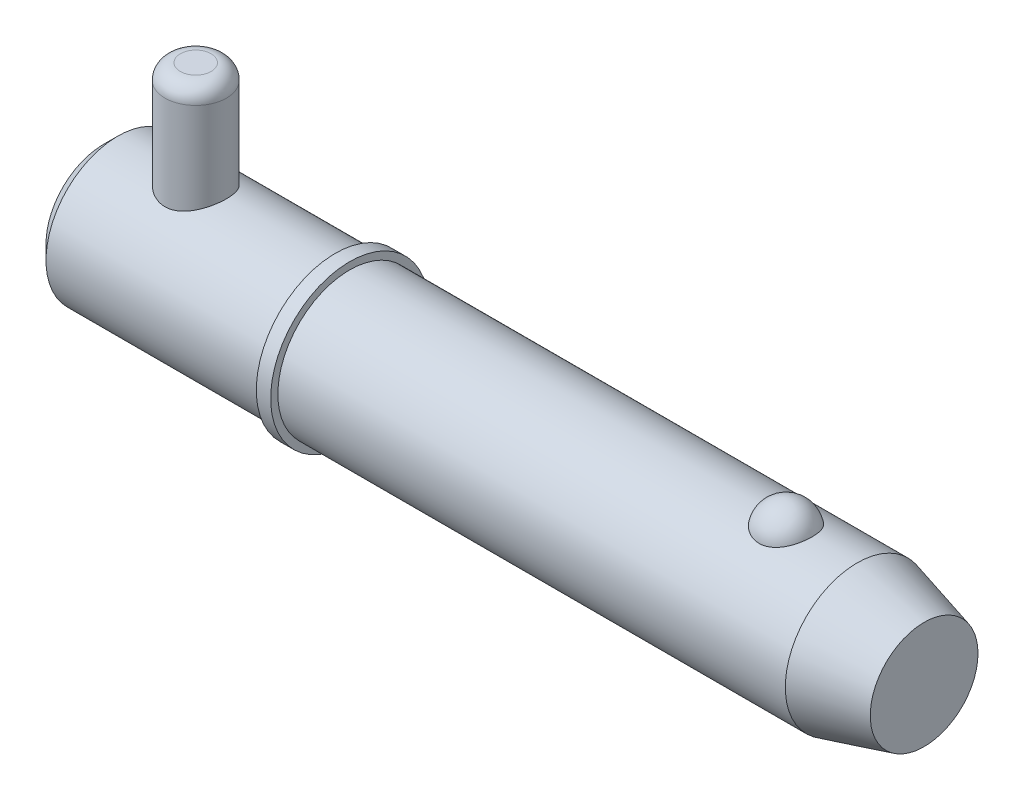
ISO-10303-21;
HEADER;
FILE_DESCRIPTION(('STEP AP214'),'2;1');
FILE_NAME('part.step','',(''),(''),'','','');
FILE_SCHEMA(('AUTOMOTIVE_DESIGN { 1 0 10303 214 1 1 1 1 }'));
ENDSEC;
DATA;
#1=APPLICATION_CONTEXT('core data for automotive mechanical design processes');
#2=APPLICATION_PROTOCOL_DEFINITION('international standard','automotive_design',2000,#1);
#3=PRODUCT_CONTEXT('',#1,'mechanical');
#4=PRODUCT('Part','Part','',(#3));
#5=PRODUCT_RELATED_PRODUCT_CATEGORY('part','',(#4));
#6=PRODUCT_DEFINITION_FORMATION('','',#4);
#7=PRODUCT_DEFINITION_CONTEXT('part definition',#1,'design');
#8=PRODUCT_DEFINITION('design','',#6,#7);
#9=PRODUCT_DEFINITION_SHAPE('','',#8);
#10=(LENGTH_UNIT() NAMED_UNIT(*) SI_UNIT(.MILLI.,.METRE.));
#11=(NAMED_UNIT(*) PLANE_ANGLE_UNIT() SI_UNIT($,.RADIAN.));
#12=(NAMED_UNIT(*) SI_UNIT($,.STERADIAN.) SOLID_ANGLE_UNIT());
#13=UNCERTAINTY_MEASURE_WITH_UNIT(LENGTH_MEASURE(1.E-05),#10,'distance_accuracy_value','');
#14=(GEOMETRIC_REPRESENTATION_CONTEXT(3) GLOBAL_UNCERTAINTY_ASSIGNED_CONTEXT((#13)) GLOBAL_UNIT_ASSIGNED_CONTEXT((#10,
#11,#12)) REPRESENTATION_CONTEXT('',''));
#15=CARTESIAN_POINT('',(0.,0.,0.));
#16=DIRECTION('',(0.,0.,1.));
#17=DIRECTION('',(1.,0.,0.));
#18=AXIS2_PLACEMENT_3D('',#15,#16,#17);
#19=CARTESIAN_POINT('',(14.28,26.985,0.));
#20=DIRECTION('',(0.,-1.,0.));
#21=DIRECTION('',(0.,0.,-1.));
#22=AXIS2_PLACEMENT_3D('',#19,#20,#21);
#23=CYLINDRICAL_SURFACE('',#22,4.76);
#24=CARTESIAN_POINT('',(14.28,-8.73500000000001,0.));
#25=DIRECTION('',(0.,1.,0.));
#26=DIRECTION('',(0.,0.,1.));
#27=AXIS2_PLACEMENT_3D('',#24,#25,#26);
#28=CIRCLE('',#27,4.76);
#29=CARTESIAN_POINT('',(14.28,-8.73500000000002,-4.76));
#30=VERTEX_POINT('',#29);
#31=EDGE_CURVE('P0_E25',#30,#30,#28,.T.);
#32=CARTESIAN_POINT('',(14.28,24.605,0.));
#33=DIRECTION('',(0.,1.,0.));
#34=DIRECTION('',(0.,0.,1.));
#35=AXIS2_PLACEMENT_3D('',#32,#33,#34);
#36=CIRCLE('',#35,4.76);
#37=CARTESIAN_POINT('',(14.28,24.605,-4.76));
#38=VERTEX_POINT('',#37);
#39=EDGE_CURVE('P0_E29',#38,#38,#36,.F.);
#40=CARTESIAN_POINT('',(14.28,-8.73500000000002,-4.76));
#41=CARTESIAN_POINT('',(14.28,-8.38770833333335,-4.76));
#42=CARTESIAN_POINT('',(14.28,-8.04041666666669,-4.76));
#43=CARTESIAN_POINT('',(14.28,-7.34583333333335,-4.76));
#44=CARTESIAN_POINT('',(14.28,-6.99854166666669,-4.76));
#45=CARTESIAN_POINT('',(14.28,-6.30395833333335,-4.76));
#46=CARTESIAN_POINT('',(14.28,-5.95666666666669,-4.76));
#47=CARTESIAN_POINT('',(14.28,-5.26208333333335,-4.76));
#48=CARTESIAN_POINT('',(14.28,-4.91479166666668,-4.76));
#49=CARTESIAN_POINT('',(14.28,-4.22020833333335,-4.76));
#50=CARTESIAN_POINT('',(14.28,-3.87291666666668,-4.76));
#51=CARTESIAN_POINT('',(14.28,-3.17833333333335,-4.76));
#52=CARTESIAN_POINT('',(14.28,-2.83104166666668,-4.76));
#53=CARTESIAN_POINT('',(14.28,-2.13645833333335,-4.76));
#54=CARTESIAN_POINT('',(14.28,-1.78916666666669,-4.76));
#55=CARTESIAN_POINT('',(14.28,-1.09458333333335,-4.76));
#56=CARTESIAN_POINT('',(14.28,-0.747291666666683,-4.76));
#57=CARTESIAN_POINT('',(14.28,-0.052708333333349,-4.76));
#58=CARTESIAN_POINT('',(14.28,0.294583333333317,-4.76));
#59=CARTESIAN_POINT('',(14.28,0.989166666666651,-4.76));
#60=CARTESIAN_POINT('',(14.28,1.33645833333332,-4.76));
#61=CARTESIAN_POINT('',(14.28,2.03104166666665,-4.76));
#62=CARTESIAN_POINT('',(14.28,2.37833333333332,-4.76));
#63=CARTESIAN_POINT('',(14.28,3.07291666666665,-4.76));
#64=CARTESIAN_POINT('',(14.28,3.42020833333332,-4.76));
#65=CARTESIAN_POINT('',(14.28,4.11479166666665,-4.76));
#66=CARTESIAN_POINT('',(14.28,4.46208333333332,-4.76));
#67=CARTESIAN_POINT('',(14.28,5.15666666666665,-4.76));
#68=CARTESIAN_POINT('',(14.28,5.50395833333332,-4.76));
#69=CARTESIAN_POINT('',(14.28,6.19854166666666,-4.76));
#70=CARTESIAN_POINT('',(14.28,6.54583333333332,-4.76));
#71=CARTESIAN_POINT('',(14.28,7.24041666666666,-4.76));
#72=CARTESIAN_POINT('',(14.28,7.58770833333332,-4.76));
#73=CARTESIAN_POINT('',(14.28,8.28229166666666,-4.76));
#74=CARTESIAN_POINT('',(14.28,8.62958333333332,-4.76));
#75=CARTESIAN_POINT('',(14.28,9.32416666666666,-4.76));
#76=CARTESIAN_POINT('',(14.28,9.67145833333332,-4.76));
#77=CARTESIAN_POINT('',(14.28,10.3660416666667,-4.76));
#78=CARTESIAN_POINT('',(14.28,10.7133333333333,-4.76));
#79=CARTESIAN_POINT('',(14.28,11.4079166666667,-4.76));
#80=CARTESIAN_POINT('',(14.28,11.7552083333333,-4.76));
#81=CARTESIAN_POINT('',(14.28,12.4497916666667,-4.76));
#82=CARTESIAN_POINT('',(14.28,12.7970833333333,-4.76));
#83=CARTESIAN_POINT('',(14.28,13.4916666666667,-4.76));
#84=CARTESIAN_POINT('',(14.28,13.8389583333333,-4.76));
#85=CARTESIAN_POINT('',(14.28,14.5335416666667,-4.76));
#86=CARTESIAN_POINT('',(14.28,14.8808333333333,-4.76));
#87=CARTESIAN_POINT('',(14.28,15.5754166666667,-4.76));
#88=CARTESIAN_POINT('',(14.28,15.9227083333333,-4.76));
#89=CARTESIAN_POINT('',(14.28,16.6172916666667,-4.76));
#90=CARTESIAN_POINT('',(14.28,16.9645833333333,-4.76));
#91=CARTESIAN_POINT('',(14.28,17.6591666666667,-4.76));
#92=CARTESIAN_POINT('',(14.28,18.0064583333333,-4.76));
#93=CARTESIAN_POINT('',(14.28,18.7010416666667,-4.76));
#94=CARTESIAN_POINT('',(14.28,19.0483333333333,-4.76));
#95=CARTESIAN_POINT('',(14.28,19.7429166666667,-4.76));
#96=CARTESIAN_POINT('',(14.28,20.0902083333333,-4.76));
#97=CARTESIAN_POINT('',(14.28,20.7847916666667,-4.76));
#98=CARTESIAN_POINT('',(14.28,21.1320833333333,-4.76));
#99=CARTESIAN_POINT('',(14.28,21.8266666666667,-4.76));
#100=CARTESIAN_POINT('',(14.28,22.1739583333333,-4.76));
#101=CARTESIAN_POINT('',(14.28,22.8685416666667,-4.76));
#102=CARTESIAN_POINT('',(14.28,23.2158333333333,-4.76));
#103=CARTESIAN_POINT('',(14.28,23.9104166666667,-4.76));
#104=CARTESIAN_POINT('',(14.28,24.2577083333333,-4.76));
#105=CARTESIAN_POINT('',(14.28,24.605,-4.76));
#106=B_SPLINE_CURVE_WITH_KNOTS('',3,(#40,#41,#42,#43,#44,#45,#46,#47,#48,#49,#50,#51,#52,#53,
#54,#55,#56,#57,#58,#59,#60,#61,#62,#63,#64,#65,#66,#67,#68,#69,#70,#71,#72,#73,#74,#75,#76,#77,
#78,#79,#80,#81,#82,#83,#84,#85,#86,#87,#88,#89,#90,#91,#92,#93,#94,#95,#96,#97,#98,#99,#100,
#101,#102,#103,#104,#105),.UNSPECIFIED.,.F.,.F.,(4,2,2,2,2,2,2,2,2,2,2,2,2,2,2,2,2,2,2,2,2,2,2,
2,2,2,2,2,2,2,2,2,4),(0.,1.041875,2.08375,3.125625,4.1675,5.209375,6.25125,7.293125,
8.33500000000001,9.376875,10.41875,11.460625,12.5025,13.544375,14.58625,15.628125,16.67,
17.711875,18.75375,19.795625,20.8375,21.879375,22.92125,23.963125,25.005,26.046875,27.08875,
28.130625,29.1725,30.214375,31.25625,32.298125,33.34),.UNSPECIFIED.);
#107=EDGE_CURVE('P0_BSEAM14',#30,#38,#106,.T.);
#108=ORIENTED_EDGE('',*,*,#31,.T.);
#109=ORIENTED_EDGE('',*,*,#39,.T.);
#110=ORIENTED_EDGE('',*,*,#107,.T.);
#111=ORIENTED_EDGE('',*,*,#107,.F.);
#112=EDGE_LOOP('',(#108,#110,#109,#111));
#113=FACE_BOUND('',#112,.T.);
#114=ADVANCED_FACE('P0_F14',(#113),#23,.T.);
#115=CARTESIAN_POINT('',(14.28,26.985,0.));
#116=DIRECTION('',(0.,1.,0.));
#117=DIRECTION('',(0.,0.,1.));
#118=AXIS2_PLACEMENT_3D('',#115,#116,#117);
#119=PLANE('',#118);
#120=CARTESIAN_POINT('',(14.28,26.985,0.));
#121=DIRECTION('',(0.,1.,0.));
#122=DIRECTION('',(0.,0.,1.));
#123=AXIS2_PLACEMENT_3D('',#120,#121,#122);
#124=CIRCLE('',#123,2.38);
#125=CARTESIAN_POINT('',(14.28,26.985,2.38));
#126=VERTEX_POINT('',#125);
#127=EDGE_CURVE('P0_E10',#126,#126,#124,.T.);
#128=ORIENTED_EDGE('',*,*,#127,.T.);
#129=EDGE_LOOP('',(#128));
#130=FACE_BOUND('',#129,.T.);
#131=ADVANCED_FACE('P0_F46',(#130),#119,.T.);
#132=CARTESIAN_POINT('',(14.28,-11.115,0.));
#133=DIRECTION('',(0.,1.,0.));
#134=DIRECTION('',(0.,0.,1.));
#135=AXIS2_PLACEMENT_3D('',#132,#133,#134);
#136=PLANE('',#135);
#137=CARTESIAN_POINT('',(14.28,-11.115,0.));
#138=DIRECTION('',(0.,1.,0.));
#139=DIRECTION('',(0.,0.,1.));
#140=AXIS2_PLACEMENT_3D('',#137,#138,#139);
#141=CIRCLE('',#140,2.38);
#142=CARTESIAN_POINT('',(14.28,-11.115,2.38));
#143=VERTEX_POINT('',#142);
#144=EDGE_CURVE('P0_E21',#143,#143,#141,.F.);
#145=ORIENTED_EDGE('',*,*,#144,.T.);
#146=EDGE_LOOP('',(#145));
#147=FACE_BOUND('',#146,.T.);
#148=ADVANCED_FACE('P0_F43',(#147),#136,.F.);
#149=CARTESIAN_POINT('',(14.28,-8.735,0.));
#150=DIRECTION('',(0.,1.,0.));
#151=DIRECTION('',(0.,0.,1.));
#152=AXIS2_PLACEMENT_3D('',#149,#150,#151);
#153=DEGENERATE_TOROIDAL_SURFACE('',#152,2.38,2.38,.T.);
#154=ORIENTED_EDGE('',*,*,#144,.F.);
#155=EDGE_LOOP('',(#154));
#156=FACE_BOUND('',#155,.T.);
#157=ORIENTED_EDGE('',*,*,#31,.F.);
#158=EDGE_LOOP('',(#157));
#159=FACE_BOUND('',#158,.T.);
#160=ADVANCED_FACE('P0_F38',(#156,#159),#153,.T.);
#161=CARTESIAN_POINT('',(14.28,24.605,0.));
#162=DIRECTION('',(0.,1.,0.));
#163=DIRECTION('',(0.,0.,1.));
#164=AXIS2_PLACEMENT_3D('',#161,#162,#163);
#165=DEGENERATE_TOROIDAL_SURFACE('',#164,2.38,2.38,.T.);
#166=ORIENTED_EDGE('',*,*,#39,.F.);
#167=EDGE_LOOP('',(#166));
#168=FACE_BOUND('',#167,.T.);
#169=ORIENTED_EDGE('',*,*,#127,.F.);
#170=EDGE_LOOP('',(#169));
#171=FACE_BOUND('',#170,.T.);
#172=ADVANCED_FACE('P0_F16',(#168,#171),#165,.T.);
#173=CLOSED_SHELL('',(#114,#131,#148,#160,#172));
#174=MANIFOLD_SOLID_BREP('P0_B1',#173);
#175=CARTESIAN_POINT('',(0.,0.,0.));
#176=DIRECTION('',(1.,0.,0.));
#177=DIRECTION('',(0.,0.,-1.));
#178=AXIS2_PLACEMENT_3D('',#175,#176,#177);
#179=CYLINDRICAL_SURFACE('',#178,11.115);
#180=CARTESIAN_POINT('',(116.629563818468,0.,0.));
#181=DIRECTION('',(1.,0.,0.));
#182=DIRECTION('',(0.,0.,-1.));
#183=AXIS2_PLACEMENT_3D('',#180,#181,#182);
#184=CIRCLE('',#183,11.115);
#185=CARTESIAN_POINT('',(116.629563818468,0.,-11.115));
#186=VERTEX_POINT('',#185);
#187=EDGE_CURVE('P1_E81',#186,#186,#184,.T.);
#188=ORIENTED_EDGE('',*,*,#187,.F.);
#189=EDGE_LOOP('',(#188));
#190=FACE_BOUND('',#189,.T.);
#191=CARTESIAN_POINT('',(38.1,0.,0.));
#192=DIRECTION('',(1.,0.,0.));
#193=DIRECTION('',(0.,0.,-1.));
#194=AXIS2_PLACEMENT_3D('',#191,#192,#193);
#195=CIRCLE('',#194,11.115);
#196=CARTESIAN_POINT('',(38.1,0.,-11.115));
#197=VERTEX_POINT('',#196);
#198=EDGE_CURVE('P1_E85',#197,#197,#195,.T.);
#199=ORIENTED_EDGE('',*,*,#198,.T.);
#200=EDGE_LOOP('',(#199));
#201=FACE_BOUND('',#200,.T.);
#202=CARTESIAN_POINT('',(105.631068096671,10.3028087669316,4.17077409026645));
#203=CARTESIAN_POINT('',(105.414775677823,10.3028003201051,4.17078240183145));
#204=CARTESIAN_POINT('',(105.198548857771,10.3098895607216,4.15340593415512));
#205=CARTESIAN_POINT('',(104.772540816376,10.3373834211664,4.08449540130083));
#206=CARTESIAN_POINT('',(104.562757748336,10.3577841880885,4.03297121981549));
#207=CARTESIAN_POINT('',(104.155782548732,10.4095237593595,3.89746513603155));
#208=CARTESIAN_POINT('',(103.958572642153,10.4408466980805,3.81353029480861));
#209=CARTESIAN_POINT('',(103.581338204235,10.5110236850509,3.61560339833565));
#210=CARTESIAN_POINT('',(103.401317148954,10.5498792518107,3.50160528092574));
#211=CARTESIAN_POINT('',(103.057684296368,10.6322884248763,3.24292464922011));
#212=CARTESIAN_POINT('',(102.894686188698,10.6759443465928,3.09746040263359));
#213=CARTESIAN_POINT('',(102.594591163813,10.7625291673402,2.78171925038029));
#214=CARTESIAN_POINT('',(102.457499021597,10.8054579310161,2.61143778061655));
#215=CARTESIAN_POINT('',(102.206408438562,10.8881935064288,2.24226695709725));
#216=CARTESIAN_POINT('',(102.093710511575,10.9277761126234,2.04244123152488));
#217=CARTESIAN_POINT('',(101.901777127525,10.997484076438,1.62578254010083));
#218=CARTESIAN_POINT('',(101.822544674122,11.0276085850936,1.40894804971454));
#219=CARTESIAN_POINT('',(101.698303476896,11.0756732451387,0.961250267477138));
#220=CARTESIAN_POINT('',(101.653760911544,11.0934470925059,0.730239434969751));
#221=CARTESIAN_POINT('',(101.601569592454,11.1143331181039,0.263439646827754));
#222=CARTESIAN_POINT('',(101.593920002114,11.1174456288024,0.0276507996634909));
#223=CARTESIAN_POINT('',(101.61561056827,11.1087161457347,-0.440729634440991));
#224=CARTESIAN_POINT('',(101.644762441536,11.0969502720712,-0.673331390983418));
#225=CARTESIAN_POINT('',(101.739143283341,11.0597872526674,-1.12996621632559));
#226=CARTESIAN_POINT('',(101.804372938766,11.0343898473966,-1.35399912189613));
#227=CARTESIAN_POINT('',(101.96969844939,10.972515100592,-1.78750286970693));
#228=CARTESIAN_POINT('',(102.06983863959,10.9360236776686,-1.99695478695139));
#229=CARTESIAN_POINT('',(102.302940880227,10.8557595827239,-2.3952066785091));
#230=CARTESIAN_POINT('',(102.435905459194,10.8119863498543,-2.5840050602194));
#231=CARTESIAN_POINT('',(102.732407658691,10.7216733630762,-2.93635726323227));
#232=CARTESIAN_POINT('',(102.896056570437,10.675123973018,-3.09981510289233));
#233=CARTESIAN_POINT('',(103.249860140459,10.5846571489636,-3.39592247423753));
#234=CARTESIAN_POINT('',(103.440012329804,10.5407394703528,-3.52857487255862));
#235=CARTESIAN_POINT('',(103.83750141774,10.4616690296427,-3.75646057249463));
#236=CARTESIAN_POINT('',(104.04436705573,10.4263443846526,-3.85245432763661));
#237=CARTESIAN_POINT('',(104.472954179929,10.3675574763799,-4.00798747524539));
#238=CARTESIAN_POINT('',(104.694670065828,10.3440907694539,-4.06754052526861));
#239=CARTESIAN_POINT('',(105.134669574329,10.3128282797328,-4.14614314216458));
#240=CARTESIAN_POINT('',(105.352565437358,10.3043040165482,-4.1670783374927));
#241=CARTESIAN_POINT('',(105.78894951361,10.3016771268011,-4.17357158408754));
#242=CARTESIAN_POINT('',(106.007437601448,10.3075716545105,-4.15913661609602));
#243=CARTESIAN_POINT('',(106.431744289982,10.3326686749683,-4.09636961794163));
#244=CARTESIAN_POINT('',(106.637745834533,10.3514555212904,-4.0490957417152));
#245=CARTESIAN_POINT('',(107.038576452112,10.399818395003,-3.92320197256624));
#246=CARTESIAN_POINT('',(107.2334046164,10.4293952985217,-3.84457953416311));
#247=CARTESIAN_POINT('',(107.611191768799,10.4969600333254,-3.65612410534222));
#248=CARTESIAN_POINT('',(107.793797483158,10.5351178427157,-3.54564545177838));
#249=CARTESIAN_POINT('',(108.138204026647,10.6154999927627,-3.29718036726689));
#250=CARTESIAN_POINT('',(108.300000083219,10.657725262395,-3.15918764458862));
#251=CARTESIAN_POINT('',(108.606959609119,10.744212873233,-2.85163580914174));
#252=CARTESIAN_POINT('',(108.750891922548,10.7884718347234,-2.68084605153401));
#253=CARTESIAN_POINT('',(109.009237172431,10.872374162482,-2.31721864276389));
#254=CARTESIAN_POINT('',(109.123644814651,10.9120167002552,-2.12437704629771));
#255=CARTESIAN_POINT('',(109.323873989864,10.9838919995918,-1.71516999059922));
#256=CARTESIAN_POINT('',(109.40866178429,11.0158465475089,-1.498248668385));
#257=CARTESIAN_POINT('',(109.54268382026,11.0673523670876,-1.052285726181));
#258=CARTESIAN_POINT('',(109.591917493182,11.086903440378,-0.823243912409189));
#259=CARTESIAN_POINT('',(109.653891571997,11.1116323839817,-0.359087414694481));
#260=CARTESIAN_POINT('',(109.666566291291,11.1167843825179,-0.123962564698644));
#261=CARTESIAN_POINT('',(109.654973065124,11.1121144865,0.345220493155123));
#262=CARTESIAN_POINT('',(109.630705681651,11.1022928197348,0.579278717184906));
#263=CARTESIAN_POINT('',(109.545907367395,11.0687504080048,1.03866534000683));
#264=CARTESIAN_POINT('',(109.485529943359,11.0450885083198,1.26402641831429));
#265=CARTESIAN_POINT('',(109.329853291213,10.9863185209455,1.70076772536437));
#266=CARTESIAN_POINT('',(109.234551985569,10.9512097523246,1.91214712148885));
#267=CARTESIAN_POINT('',(109.010397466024,10.8729733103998,2.31608359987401));
#268=CARTESIAN_POINT('',(108.881380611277,10.8298068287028,2.50854240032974));
#269=CARTESIAN_POINT('',(108.592732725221,10.7401896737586,2.86808766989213));
#270=CARTESIAN_POINT('',(108.433102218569,10.6937390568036,3.03517457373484));
#271=CARTESIAN_POINT('',(108.087534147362,10.6029321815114,3.33857581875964));
#272=CARTESIAN_POINT('',(107.901708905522,10.5585680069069,3.47501541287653));
#273=CARTESIAN_POINT('',(107.507875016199,10.4769321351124,3.71390897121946));
#274=CARTESIAN_POINT('',(107.299863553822,10.439661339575,3.81635861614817));
#275=CARTESIAN_POINT('',(106.854066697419,10.3749407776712,3.98910631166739));
#276=CARTESIAN_POINT('',(106.615234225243,10.3482457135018,4.05700929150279));
#277=CARTESIAN_POINT('',(106.127925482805,10.312188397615,4.14782844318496));
#278=CARTESIAN_POINT('',(105.879453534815,10.3028184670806,4.17076454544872));
#279=CARTESIAN_POINT('',(105.631068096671,10.3028087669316,4.17077409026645));
#280=B_SPLINE_CURVE_WITH_KNOTS('',3,(#202,#203,#204,#205,#206,#207,#208,#209,#210,#211,#212,
#213,#214,#215,#216,#217,#218,#219,#220,#221,#222,#223,#224,#225,#226,#227,#228,#229,#230,#231,
#232,#233,#234,#235,#236,#237,#238,#239,#240,#241,#242,#243,#244,#245,#246,#247,#248,#249,#250,
#251,#252,#253,#254,#255,#256,#257,#258,#259,#260,#261,#262,#263,#264,#265,#266,#267,#268,#269,
#270,#271,#272,#273,#274,#275,#276,#277,#278,#279),.UNSPECIFIED.,.T.,.F.,(4,2,2,2,2,2,2,2,2,2,2,
2,2,2,2,2,2,2,2,2,2,2,2,2,2,2,2,2,2,2,2,2,2,2,2,2,2,2,4),(0.,0.647966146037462,1.29574482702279,
1.94258643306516,2.58955857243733,3.25496465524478,3.92049326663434,4.61566368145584,
5.31089647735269,6.01531821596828,6.71972398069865,7.42054043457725,8.12137023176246,
8.82309331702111,9.52487047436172,10.2292439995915,10.9335519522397,11.6223330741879,
12.3108558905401,12.9647664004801,13.6185478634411,14.2521847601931,14.8858731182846,
15.5334360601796,16.1811472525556,16.8611459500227,17.5412664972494,18.2431855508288,
18.9451158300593,19.6483065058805,20.3514864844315,21.0516982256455,21.7519516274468,
22.4556690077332,23.1593743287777,23.8601491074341,24.5610129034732,25.3054529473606,
26.049562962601),.UNSPECIFIED.);
#281=CARTESIAN_POINT('',(105.631068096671,10.3028087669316,4.17077409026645));
#282=VERTEX_POINT('',#281);
#283=EDGE_CURVE('P1_E35',#282,#282,#280,.T.);
#284=ORIENTED_EDGE('',*,*,#283,.T.);
#285=EDGE_LOOP('',(#284));
#286=FACE_BOUND('',#285,.T.);
#287=ADVANCED_FACE('P1_F13',(#190,#201,#286),#179,.T.);
#288=CARTESIAN_POINT('',(0.,0.,0.));
#289=DIRECTION('',(-1.,0.,0.));
#290=DIRECTION('',(0.,0.,1.));
#291=AXIS2_PLACEMENT_3D('',#288,#289,#290);
#292=PLANE('',#291);
#293=CARTESIAN_POINT('',(0.,0.,0.));
#294=DIRECTION('',(1.,0.,0.));
#295=DIRECTION('',(0.,0.,-1.));
#296=AXIS2_PLACEMENT_3D('',#293,#294,#295);
#297=CIRCLE('',#296,8.892);
#298=CARTESIAN_POINT('',(0.,0.,-8.892));
#299=VERTEX_POINT('',#298);
#300=EDGE_CURVE('P1_E9',#299,#299,#297,.T.);
#301=ORIENTED_EDGE('',*,*,#300,.F.);
#302=EDGE_LOOP('',(#301));
#303=FACE_BOUND('',#302,.T.);
#304=ADVANCED_FACE('P1_F15',(#303),#292,.T.);
#305=CARTESIAN_POINT('',(2.22299999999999,0.,0.));
#306=DIRECTION('',(1.,0.,0.));
#307=DIRECTION('',(0.,0.,-1.));
#308=AXIS2_PLACEMENT_3D('',#305,#306,#307);
#309=CONICAL_SURFACE('',#308,11.115,0.78539816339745);
#310=ORIENTED_EDGE('',*,*,#300,.T.);
#311=EDGE_LOOP('',(#310));
#312=FACE_BOUND('',#311,.T.);
#313=CARTESIAN_POINT('',(2.22299999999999,0.,0.));
#314=DIRECTION('',(1.,0.,0.));
#315=DIRECTION('',(0.,0.,-1.));
#316=AXIS2_PLACEMENT_3D('',#313,#314,#315);
#317=CIRCLE('',#316,11.115);
#318=CARTESIAN_POINT('',(2.22299999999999,0.,-11.115));
#319=VERTEX_POINT('',#318);
#320=EDGE_CURVE('P1_E26',#319,#319,#317,.T.);
#321=ORIENTED_EDGE('',*,*,#320,.F.);
#322=EDGE_LOOP('',(#321));
#323=FACE_BOUND('',#322,.T.);
#324=ADVANCED_FACE('P1_F77',(#312,#323),#309,.T.);
#325=CARTESIAN_POINT('',(0.,0.,0.));
#326=DIRECTION('',(1.,0.,0.));
#327=DIRECTION('',(0.,0.,-1.));
#328=AXIS2_PLACEMENT_3D('',#325,#326,#327);
#329=CYLINDRICAL_SURFACE('',#328,11.115);
#330=CARTESIAN_POINT('',(14.28,-10.0441836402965,4.76));
#331=CARTESIAN_POINT('',(14.1533731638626,-10.0441846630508,4.75999904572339));
#332=CARTESIAN_POINT('',(14.0267055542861,-10.0465865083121,4.75493985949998));
#333=CARTESIAN_POINT('',(13.774298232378,-10.0561141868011,4.73475585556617));
#334=CARTESIAN_POINT('',(13.6485591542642,-10.0632429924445,4.71962470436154));
#335=CARTESIAN_POINT('',(13.3987500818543,-10.0819979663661,4.67942666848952));
#336=CARTESIAN_POINT('',(13.2746840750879,-10.0936334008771,4.65433930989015));
#337=CARTESIAN_POINT('',(13.0293244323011,-10.1210146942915,4.59449317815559));
#338=CARTESIAN_POINT('',(12.9080319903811,-10.1367622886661,4.55973032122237));
#339=CARTESIAN_POINT('',(12.669614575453,-10.1717810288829,4.48106435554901));
#340=CARTESIAN_POINT('',(12.5524727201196,-10.1910352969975,4.4372048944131));
#341=CARTESIAN_POINT('',(12.3224300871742,-10.2325403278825,4.34063417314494));
#342=CARTESIAN_POINT('',(12.2095309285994,-10.2547922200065,4.28791957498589));
#343=CARTESIAN_POINT('',(11.8782785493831,-10.3250879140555,4.11715127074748));
#344=CARTESIAN_POINT('',(11.6670799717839,-10.3767168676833,3.98637638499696));
#345=CARTESIAN_POINT('',(11.2564039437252,-10.4874309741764,3.68567149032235));
#346=CARTESIAN_POINT('',(11.0583793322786,-10.5467772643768,3.51386978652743));
#347=CARTESIAN_POINT('',(10.6927724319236,-10.6641377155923,3.13969960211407));
#348=CARTESIAN_POINT('',(10.5252022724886,-10.7221513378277,2.93731900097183));
#349=CARTESIAN_POINT('',(10.2965609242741,-10.8050020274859,2.60935726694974));
#350=CARTESIAN_POINT('',(10.2227768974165,-10.8324811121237,2.49310321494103));
#351=CARTESIAN_POINT('',(10.0853380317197,-10.884703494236,2.25418999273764));
#352=CARTESIAN_POINT('',(10.0216789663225,-10.9094479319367,2.13153352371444));
#353=CARTESIAN_POINT('',(9.90506238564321,-10.9554932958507,1.88060370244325));
#354=CARTESIAN_POINT('',(9.85210574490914,-10.9767939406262,1.7523298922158));
#355=CARTESIAN_POINT('',(9.75746464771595,-11.0153112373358,1.49115740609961));
#356=CARTESIAN_POINT('',(9.71577447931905,-11.0325299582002,1.35826111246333));
#357=CARTESIAN_POINT('',(9.64605475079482,-11.0615607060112,1.09614539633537));
#358=CARTESIAN_POINT('',(9.61740732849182,-11.0736151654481,0.96711700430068));
#359=CARTESIAN_POINT('',(9.57092026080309,-11.0932687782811,0.706847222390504));
#360=CARTESIAN_POINT('',(9.55307574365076,-11.1008699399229,0.575606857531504));
#361=CARTESIAN_POINT('',(9.52838640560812,-11.1114054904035,0.31192917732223));
#362=CARTESIAN_POINT('',(9.52153986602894,-11.114340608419,0.179492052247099));
#363=CARTESIAN_POINT('',(9.51892405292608,-11.1154607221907,-0.0855090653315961));
#364=CARTESIAN_POINT('',(9.52315432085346,-11.1136459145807,-0.218073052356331));
#365=CARTESIAN_POINT('',(9.542009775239,-11.1055891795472,-0.473709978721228));
#366=CARTESIAN_POINT('',(9.55594693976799,-11.099640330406,-0.596843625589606));
#367=CARTESIAN_POINT('',(9.59332832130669,-11.0837823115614,-0.841440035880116));
#368=CARTESIAN_POINT('',(9.61677567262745,-11.0738718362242,-0.962902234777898));
#369=CARTESIAN_POINT('',(9.67294089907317,-11.0503378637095,-1.20325684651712));
#370=CARTESIAN_POINT('',(9.70565569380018,-11.0367156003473,-1.32215009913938));
#371=CARTESIAN_POINT('',(9.78005008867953,-11.0060908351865,-1.55666640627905));
#372=CARTESIAN_POINT('',(9.82173311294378,-10.9890870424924,-1.67228819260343));
#373=CARTESIAN_POINT('',(9.96110379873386,-10.9330280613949,-2.01656166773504));
#374=CARTESIAN_POINT('',(10.0722987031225,-10.8892801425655,-2.23915547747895));
#375=CARTESIAN_POINT('',(10.3268588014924,-10.7934745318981,-2.66299199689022));
#376=CARTESIAN_POINT('',(10.4702355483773,-10.7414138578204,-2.86422700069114));
#377=CARTESIAN_POINT('',(10.7973904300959,-10.6296201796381,-3.25557775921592));
#378=CARTESIAN_POINT('',(10.9833705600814,-10.569604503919,-3.443774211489));
#379=CARTESIAN_POINT('',(11.3844486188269,-10.4514707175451,-3.78722133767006));
#380=CARTESIAN_POINT('',(11.5995590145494,-10.3933534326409,-3.94245783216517));
#381=CARTESIAN_POINT('',(11.9444340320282,-10.311516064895,-4.14990014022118));
#382=CARTESIAN_POINT('',(12.0654579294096,-10.2847012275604,-4.21573894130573));
#383=CARTESIAN_POINT('',(12.3132718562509,-10.2342051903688,-4.33688518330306));
#384=CARTESIAN_POINT('',(12.4400593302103,-10.2105226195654,-4.39219723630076));
#385=CARTESIAN_POINT('',(12.6985418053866,-10.1671237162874,-4.49174500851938));
#386=CARTESIAN_POINT('',(12.8302359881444,-10.1474067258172,-4.53598256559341));
#387=CARTESIAN_POINT('',(13.0975061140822,-10.1126841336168,-4.61287629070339));
#388=CARTESIAN_POINT('',(13.233079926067,-10.0976759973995,-4.64553869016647));
#389=CARTESIAN_POINT('',(13.4978553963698,-10.0737863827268,-4.6971059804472));
#390=CARTESIAN_POINT('',(13.6268754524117,-10.0645618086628,-4.716785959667));
#391=CARTESIAN_POINT('',(13.8862990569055,-10.051062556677,-4.74548419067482));
#392=CARTESIAN_POINT('',(14.0167019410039,-10.0467856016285,-4.75450734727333));
#393=CARTESIAN_POINT('',(14.277859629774,-10.0433352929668,-4.76179143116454));
#394=CARTESIAN_POINT('',(14.4086143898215,-10.0441613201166,-4.76005366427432));
#395=CARTESIAN_POINT('',(14.6694025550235,-10.0508838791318,-4.74584231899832));
#396=CARTESIAN_POINT('',(14.7994359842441,-10.0567802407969,-4.73336910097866));
#397=CARTESIAN_POINT('',(15.0487369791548,-10.0728449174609,-4.69907984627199));
#398=CARTESIAN_POINT('',(15.1681238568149,-10.0826872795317,-4.67797462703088));
#399=CARTESIAN_POINT('',(15.4045894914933,-10.1062580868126,-4.62682977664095));
#400=CARTESIAN_POINT('',(15.5216674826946,-10.1199877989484,-4.59678723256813));
#401=CARTESIAN_POINT('',(15.868278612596,-10.1664161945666,-4.49365911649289));
#402=CARTESIAN_POINT('',(16.0933756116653,-10.2043671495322,-4.40754694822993));
#403=CARTESIAN_POINT('',(16.5357981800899,-10.2919879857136,-4.19898201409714));
#404=CARTESIAN_POINT('',(16.7523611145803,-10.3420954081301,-4.07511281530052));
#405=CARTESIAN_POINT('',(17.1627188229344,-10.4477911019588,-3.7959429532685));
#406=CARTESIAN_POINT('',(17.3565033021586,-10.5033818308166,-3.64062816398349));
#407=CARTESIAN_POINT('',(17.7334034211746,-10.6196376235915,-3.28693729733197));
#408=CARTESIAN_POINT('',(17.9141276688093,-10.6803237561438,-3.08599175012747));
#409=CARTESIAN_POINT('',(18.1582189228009,-10.7666348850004,-2.76320365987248));
#410=CARTESIAN_POINT('',(18.2351223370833,-10.7946346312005,-2.65197124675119));
#411=CARTESIAN_POINT('',(18.3793967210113,-10.8483267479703,-2.42297927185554));
#412=CARTESIAN_POINT('',(18.4467718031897,-10.87402011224,-2.30522255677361));
#413=CARTESIAN_POINT('',(18.5717669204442,-10.9225249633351,-2.06324665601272));
#414=CARTESIAN_POINT('',(18.6293326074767,-10.9453202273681,-1.93899615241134));
#415=CARTESIAN_POINT('',(18.73370006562,-10.9872100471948,-1.6855059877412));
#416=CARTESIAN_POINT('',(18.7805065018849,-11.0063062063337,-1.55626851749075));
#417=CARTESIAN_POINT('',(18.8628731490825,-11.0402419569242,-1.29375150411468));
#418=CARTESIAN_POINT('',(18.8984366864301,-11.0550828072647,-1.16047316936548));
#419=CARTESIAN_POINT('',(18.9579183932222,-11.0800638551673,-0.890912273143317));
#420=CARTESIAN_POINT('',(18.9818374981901,-11.0902044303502,-0.75462995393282));
#421=CARTESIAN_POINT('',(19.0164177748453,-11.104911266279,-0.490295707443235));
#422=CARTESIAN_POINT('',(19.027922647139,-11.1098318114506,-0.362373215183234));
#423=CARTESIAN_POINT('',(19.040554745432,-11.1152360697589,-0.105876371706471));
#424=CARTESIAN_POINT('',(19.0416784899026,-11.1157182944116,0.0226981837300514));
#425=CARTESIAN_POINT('',(19.0335275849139,-11.1122291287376,0.27938352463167));
#426=CARTESIAN_POINT('',(19.0242587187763,-11.1082602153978,0.407494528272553));
#427=CARTESIAN_POINT('',(18.9954320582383,-11.0959792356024,0.662388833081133));
#428=CARTESIAN_POINT('',(18.9758704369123,-11.0876655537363,0.789171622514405));
#429=CARTESIAN_POINT('',(18.9276379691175,-11.0673259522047,1.03545890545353));
#430=CARTESIAN_POINT('',(18.8993573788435,-11.0554596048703,1.15505309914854));
#431=CARTESIAN_POINT('',(18.8337694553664,-11.0282166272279,1.39134516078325));
#432=CARTESIAN_POINT('',(18.7964589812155,-11.0128387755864,1.5080420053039));
#433=CARTESIAN_POINT('',(18.671464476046,-10.9619666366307,1.85262797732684));
#434=CARTESIAN_POINT('',(18.5706772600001,-10.9217161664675,2.07521484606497));
#435=CARTESIAN_POINT('',(18.33202463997,-10.8301378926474,2.51061719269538));
#436=CARTESIAN_POINT('',(18.1926775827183,-10.7783885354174,2.72252375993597));
#437=CARTESIAN_POINT('',(17.8829747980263,-10.669863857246,3.12088015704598));
#438=CARTESIAN_POINT('',(17.7126068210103,-10.6130865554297,3.30731987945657));
#439=CARTESIAN_POINT('',(17.3310036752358,-10.495668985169,3.66358491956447));
#440=CARTESIAN_POINT('',(17.1177010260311,-10.4350471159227,3.83122543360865));
#441=CARTESIAN_POINT('',(16.7778915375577,-10.3495418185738,4.05420569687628));
#442=CARTESIAN_POINT('',(16.6612023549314,-10.3219229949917,4.12383380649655));
#443=CARTESIAN_POINT('',(16.4218466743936,-10.2693487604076,4.25306463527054));
#444=CARTESIAN_POINT('',(16.2991829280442,-10.2443921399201,4.31267191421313));
#445=CARTESIAN_POINT('',(16.0488008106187,-10.1979981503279,4.42126071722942));
#446=CARTESIAN_POINT('',(15.9210894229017,-10.1765561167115,4.47025635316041));
#447=CARTESIAN_POINT('',(15.6613937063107,-10.1379191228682,4.55720152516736));
#448=CARTESIAN_POINT('',(15.5294115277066,-10.1207220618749,4.59515652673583));
#449=CARTESIAN_POINT('',(15.2624981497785,-10.091252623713,4.65951684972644));
#450=CARTESIAN_POINT('',(15.1275757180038,-10.0789672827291,4.68595259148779));
#451=CARTESIAN_POINT('',(14.8556442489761,-10.0597530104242,4.72706206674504));
#452=CARTESIAN_POINT('',(14.7186368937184,-10.0528199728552,4.74174481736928));
#453=CARTESIAN_POINT('',(14.5310955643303,-10.047196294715,4.75363843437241));
#454=CARTESIAN_POINT('',(14.48091543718,-10.0460674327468,4.75602323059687));
#455=CARTESIAN_POINT('',(14.3804923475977,-10.044560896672,4.7592042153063));
#456=CARTESIAN_POINT('',(14.3302493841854,-10.0441832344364,4.76000037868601));
#457=CARTESIAN_POINT('',(14.28,-10.0441836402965,4.76));
#458=B_SPLINE_CURVE_WITH_KNOTS('',3,(#330,#331,#332,#333,#334,#335,#336,#337,#338,#339,#340,
#341,#342,#343,#344,#345,#346,#347,#348,#349,#350,#351,#352,#353,#354,#355,#356,#357,#358,#359,
#360,#361,#362,#363,#364,#365,#366,#367,#368,#369,#370,#371,#372,#373,#374,#375,#376,#377,#378,
#379,#380,#381,#382,#383,#384,#385,#386,#387,#388,#389,#390,#391,#392,#393,#394,#395,#396,#397,
#398,#399,#400,#401,#402,#403,#404,#405,#406,#407,#408,#409,#410,#411,#412,#413,#414,#415,#416,
#417,#418,#419,#420,#421,#422,#423,#424,#425,#426,#427,#428,#429,#430,#431,#432,#433,#434,#435,
#436,#437,#438,#439,#440,#441,#442,#443,#444,#445,#446,#447,#448,#449,#450,#451,#452,#453,#454,
#455,#456,#457),.UNSPECIFIED.,.T.,.F.,(4,2,2,2,2,2,2,2,2,2,2,2,2,2,2,2,2,2,2,2,2,2,2,2,2,2,2,2,
2,2,2,2,2,2,2,2,2,2,2,2,2,2,2,2,2,2,2,2,2,2,2,2,2,2,2,2,2,2,2,2,2,2,2,4),(0.,0.379828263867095,
0.759895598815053,1.14074858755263,1.52176256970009,1.90098898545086,2.28035867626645,
3.03818035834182,3.84125131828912,4.6446414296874,5.06541657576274,5.48601561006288,
5.90664899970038,6.3270687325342,6.72470503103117,7.12216187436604,7.51955659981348,
7.91693487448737,8.28868404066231,8.66055582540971,9.03230414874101,9.40419465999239,
10.1585834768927,10.9132435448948,11.7236471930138,12.5343987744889,12.9550196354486,
13.3754557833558,13.7958221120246,14.2159617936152,14.6079540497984,14.9997658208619,
15.3915300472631,15.7832811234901,16.1477615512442,16.512360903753,17.240999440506,
18.0012974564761,18.761937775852,19.5886929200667,20.0025782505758,20.4162843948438,
20.832212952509,21.2479608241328,21.6635855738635,22.0791769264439,22.4642880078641,
22.8495282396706,23.2345541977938,23.6197234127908,23.9896813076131,24.3597680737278,
25.099327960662,25.8726239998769,26.6462260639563,27.4759193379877,27.8914891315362,
28.3068693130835,28.7216936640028,29.1363123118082,29.5498292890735,29.9630287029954,
30.113753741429,30.2644811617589),.UNSPECIFIED.);
#459=CARTESIAN_POINT('',(14.28,-10.0441836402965,4.76));
#460=VERTEX_POINT('',#459);
#461=EDGE_CURVE('P1_E17',#460,#460,#458,.T.);
#462=ORIENTED_EDGE('',*,*,#461,.F.);
#463=EDGE_LOOP('',(#462));
#464=FACE_BOUND('',#463,.T.);
#465=CARTESIAN_POINT('',(14.28,10.0441836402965,4.76));
#466=CARTESIAN_POINT('',(14.4066268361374,10.0441846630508,4.75999904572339));
#467=CARTESIAN_POINT('',(14.5332944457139,10.0465865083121,4.75493985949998));
#468=CARTESIAN_POINT('',(14.785701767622,10.0561141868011,4.73475585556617));
#469=CARTESIAN_POINT('',(14.9114408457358,10.0632429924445,4.71962470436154));
#470=CARTESIAN_POINT('',(15.1612499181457,10.0819979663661,4.67942666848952));
#471=CARTESIAN_POINT('',(15.2853159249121,10.0936334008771,4.65433930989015));
#472=CARTESIAN_POINT('',(15.5306755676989,10.1210146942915,4.59449317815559));
#473=CARTESIAN_POINT('',(15.6519680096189,10.1367622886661,4.55973032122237));
#474=CARTESIAN_POINT('',(15.890385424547,10.1717810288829,4.48106435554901));
#475=CARTESIAN_POINT('',(16.0075272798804,10.1910352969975,4.4372048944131));
#476=CARTESIAN_POINT('',(16.2375699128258,10.2325403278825,4.34063417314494));
#477=CARTESIAN_POINT('',(16.3504690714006,10.2547922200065,4.28791957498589));
#478=CARTESIAN_POINT('',(16.6817214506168,10.3250879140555,4.11715127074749));
#479=CARTESIAN_POINT('',(16.8929200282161,10.3767168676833,3.98637638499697));
#480=CARTESIAN_POINT('',(17.3035960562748,10.4874309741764,3.68567149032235));
#481=CARTESIAN_POINT('',(17.5016206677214,10.5467772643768,3.51386978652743));
#482=CARTESIAN_POINT('',(17.8672275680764,10.6641377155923,3.13969960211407));
#483=CARTESIAN_POINT('',(18.0347977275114,10.7221513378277,2.93731900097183));
#484=CARTESIAN_POINT('',(18.2634390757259,10.8050020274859,2.60935726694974));
#485=CARTESIAN_POINT('',(18.3372231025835,10.8324811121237,2.49310321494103));
#486=CARTESIAN_POINT('',(18.4746619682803,10.884703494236,2.25418999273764));
#487=CARTESIAN_POINT('',(18.5383210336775,10.9094479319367,2.13153352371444));
#488=CARTESIAN_POINT('',(18.6549376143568,10.9554932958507,1.88060370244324));
#489=CARTESIAN_POINT('',(18.7078942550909,10.9767939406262,1.75232989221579));
#490=CARTESIAN_POINT('',(18.8025353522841,11.0153112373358,1.4911574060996));
#491=CARTESIAN_POINT('',(18.844225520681,11.0325299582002,1.35826111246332));
#492=CARTESIAN_POINT('',(18.9139452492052,11.0615607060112,1.09614539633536));
#493=CARTESIAN_POINT('',(18.9425926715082,11.0736151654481,0.967117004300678));
#494=CARTESIAN_POINT('',(18.9890797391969,11.0932687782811,0.706847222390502));
#495=CARTESIAN_POINT('',(19.0069242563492,11.1008699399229,0.575606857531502));
#496=CARTESIAN_POINT('',(19.0316135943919,11.1114054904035,0.311929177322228));
#497=CARTESIAN_POINT('',(19.0384601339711,11.114340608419,0.179492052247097));
#498=CARTESIAN_POINT('',(19.0410759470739,11.1154607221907,-0.0855090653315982));
#499=CARTESIAN_POINT('',(19.0368456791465,11.1136459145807,-0.218073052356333));
#500=CARTESIAN_POINT('',(19.017990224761,11.1055891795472,-0.47370997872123));
#501=CARTESIAN_POINT('',(19.004053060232,11.099640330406,-0.596843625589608));
#502=CARTESIAN_POINT('',(18.9666716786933,11.0837823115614,-0.841440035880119));
#503=CARTESIAN_POINT('',(18.9432243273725,11.0738718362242,-0.9629022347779));
#504=CARTESIAN_POINT('',(18.8870591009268,11.0503378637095,-1.20325684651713));
#505=CARTESIAN_POINT('',(18.8543443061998,11.0367156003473,-1.32215009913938));
#506=CARTESIAN_POINT('',(18.7799499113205,11.0060908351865,-1.55666640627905));
#507=CARTESIAN_POINT('',(18.7382668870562,10.9890870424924,-1.67228819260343));
#508=CARTESIAN_POINT('',(18.5988962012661,10.9330280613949,-2.01656166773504));
#509=CARTESIAN_POINT('',(18.4877012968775,10.8892801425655,-2.23915547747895));
#510=CARTESIAN_POINT('',(18.2331411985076,10.7934745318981,-2.66299199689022));
#511=CARTESIAN_POINT('',(18.0897644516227,10.7414138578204,-2.86422700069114));
#512=CARTESIAN_POINT('',(17.7626095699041,10.6296201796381,-3.25557775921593));
#513=CARTESIAN_POINT('',(17.5766294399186,10.569604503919,-3.443774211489));
#514=CARTESIAN_POINT('',(17.1755513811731,10.4514707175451,-3.78722133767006));
#515=CARTESIAN_POINT('',(16.9604409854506,10.3933534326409,-3.94245783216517));
#516=CARTESIAN_POINT('',(16.6155659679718,10.311516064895,-4.14990014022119));
#517=CARTESIAN_POINT('',(16.4945420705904,10.2847012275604,-4.21573894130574));
#518=CARTESIAN_POINT('',(16.2467281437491,10.2342051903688,-4.33688518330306));
#519=CARTESIAN_POINT('',(16.1199406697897,10.2105226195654,-4.39219723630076));
#520=CARTESIAN_POINT('',(15.8614581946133,10.1671237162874,-4.49174500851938));
#521=CARTESIAN_POINT('',(15.7297640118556,10.1474067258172,-4.53598256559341));
#522=CARTESIAN_POINT('',(15.4624938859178,10.1126841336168,-4.61287629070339));
#523=CARTESIAN_POINT('',(15.326920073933,10.0976759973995,-4.64553869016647));
#524=CARTESIAN_POINT('',(15.0621446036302,10.0737863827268,-4.6971059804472));
#525=CARTESIAN_POINT('',(14.9331245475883,10.0645618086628,-4.716785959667));
#526=CARTESIAN_POINT('',(14.6737009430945,10.051062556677,-4.74548419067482));
#527=CARTESIAN_POINT('',(14.543298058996,10.0467856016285,-4.75450734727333));
#528=CARTESIAN_POINT('',(14.2821403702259,10.0433352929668,-4.76179143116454));
#529=CARTESIAN_POINT('',(14.1513856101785,10.0441613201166,-4.76005366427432));
#530=CARTESIAN_POINT('',(13.8905974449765,10.0508838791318,-4.74584231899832));
#531=CARTESIAN_POINT('',(13.7605640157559,10.0567802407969,-4.73336910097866));
#532=CARTESIAN_POINT('',(13.5112630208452,10.0728449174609,-4.69907984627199));
#533=CARTESIAN_POINT('',(13.3918761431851,10.0826872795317,-4.67797462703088));
#534=CARTESIAN_POINT('',(13.1554105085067,10.1062580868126,-4.62682977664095));
#535=CARTESIAN_POINT('',(13.0383325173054,10.1199877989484,-4.59678723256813));
#536=CARTESIAN_POINT('',(12.691721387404,10.1664161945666,-4.49365911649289));
#537=CARTESIAN_POINT('',(12.4666243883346,10.2043671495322,-4.40754694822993));
#538=CARTESIAN_POINT('',(12.0242018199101,10.2919879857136,-4.19898201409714));
#539=CARTESIAN_POINT('',(11.8076388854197,10.3420954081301,-4.07511281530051));
#540=CARTESIAN_POINT('',(11.3972811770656,10.4477911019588,-3.7959429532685));
#541=CARTESIAN_POINT('',(11.2034966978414,10.5033818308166,-3.64062816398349));
#542=CARTESIAN_POINT('',(10.8265965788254,10.6196376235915,-3.28693729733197));
#543=CARTESIAN_POINT('',(10.6458723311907,10.6803237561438,-3.08599175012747));
#544=CARTESIAN_POINT('',(10.4017810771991,10.7666348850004,-2.76320365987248));
#545=CARTESIAN_POINT('',(10.3248776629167,10.7946346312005,-2.65197124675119));
#546=CARTESIAN_POINT('',(10.1806032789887,10.8483267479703,-2.42297927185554));
#547=CARTESIAN_POINT('',(10.1132281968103,10.87402011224,-2.30522255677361));
#548=CARTESIAN_POINT('',(9.98823307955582,10.9225249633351,-2.06324665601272));
#549=CARTESIAN_POINT('',(9.93066739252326,10.9453202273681,-1.93899615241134));
#550=CARTESIAN_POINT('',(9.82629993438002,10.9872100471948,-1.6855059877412));
#551=CARTESIAN_POINT('',(9.77949349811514,11.0063062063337,-1.55626851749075));
#552=CARTESIAN_POINT('',(9.69712685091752,11.0402419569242,-1.29375150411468));
#553=CARTESIAN_POINT('',(9.66156331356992,11.0550828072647,-1.16047316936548));
#554=CARTESIAN_POINT('',(9.60208160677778,11.0800638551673,-0.890912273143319));
#555=CARTESIAN_POINT('',(9.57816250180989,11.0902044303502,-0.754629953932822));
#556=CARTESIAN_POINT('',(9.54358222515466,11.104911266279,-0.490295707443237));
#557=CARTESIAN_POINT('',(9.53207735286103,11.1098318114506,-0.362373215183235));
#558=CARTESIAN_POINT('',(9.51944525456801,11.1152360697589,-0.105876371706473));
#559=CARTESIAN_POINT('',(9.51832151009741,11.1157182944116,0.0226981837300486));
#560=CARTESIAN_POINT('',(9.52647241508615,11.1122291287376,0.279383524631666));
#561=CARTESIAN_POINT('',(9.53574128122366,11.1082602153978,0.407494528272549));
#562=CARTESIAN_POINT('',(9.5645679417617,11.0959792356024,0.662388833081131));
#563=CARTESIAN_POINT('',(9.58412956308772,11.0876655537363,0.789171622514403));
#564=CARTESIAN_POINT('',(9.63236203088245,11.0673259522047,1.03545890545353));
#565=CARTESIAN_POINT('',(9.66064262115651,11.0554596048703,1.15505309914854));
#566=CARTESIAN_POINT('',(9.72623054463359,11.0282166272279,1.39134516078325));
#567=CARTESIAN_POINT('',(9.76354101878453,11.0128387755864,1.5080420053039));
#568=CARTESIAN_POINT('',(9.88853552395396,10.9619666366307,1.85262797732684));
#569=CARTESIAN_POINT('',(9.98932273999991,10.9217161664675,2.07521484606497));
#570=CARTESIAN_POINT('',(10.22797536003,10.8301378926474,2.51061719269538));
#571=CARTESIAN_POINT('',(10.3673224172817,10.7783885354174,2.72252375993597));
#572=CARTESIAN_POINT('',(10.6770252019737,10.669863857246,3.12088015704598));
#573=CARTESIAN_POINT('',(10.8473931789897,10.6130865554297,3.30731987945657));
#574=CARTESIAN_POINT('',(11.2289963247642,10.495668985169,3.66358491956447));
#575=CARTESIAN_POINT('',(11.4422989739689,10.4350471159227,3.83122543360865));
#576=CARTESIAN_POINT('',(11.7821084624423,10.3495418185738,4.05420569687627));
#577=CARTESIAN_POINT('',(11.8987976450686,10.3219229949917,4.12383380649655));
#578=CARTESIAN_POINT('',(12.1381533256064,10.2693487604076,4.25306463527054));
#579=CARTESIAN_POINT('',(12.2608170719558,10.2443921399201,4.31267191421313));
#580=CARTESIAN_POINT('',(12.5111991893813,10.1979981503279,4.42126071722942));
#581=CARTESIAN_POINT('',(12.6389105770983,10.1765561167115,4.47025635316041));
#582=CARTESIAN_POINT('',(12.8986062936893,10.1379191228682,4.55720152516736));
#583=CARTESIAN_POINT('',(13.0305884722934,10.1207220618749,4.59515652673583));
#584=CARTESIAN_POINT('',(13.2975018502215,10.091252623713,4.65951684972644));
#585=CARTESIAN_POINT('',(13.4324242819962,10.0789672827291,4.68595259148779));
#586=CARTESIAN_POINT('',(13.7043557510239,10.0597530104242,4.72706206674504));
#587=CARTESIAN_POINT('',(13.8413631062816,10.0528199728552,4.74174481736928));
#588=CARTESIAN_POINT('',(14.0289044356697,10.047196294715,4.75363843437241));
#589=CARTESIAN_POINT('',(14.07908456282,10.0460674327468,4.75602323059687));
#590=CARTESIAN_POINT('',(14.1795076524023,10.044560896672,4.7592042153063));
#591=CARTESIAN_POINT('',(14.2297506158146,10.0441832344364,4.76000037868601));
#592=CARTESIAN_POINT('',(14.28,10.0441836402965,4.76));
#593=B_SPLINE_CURVE_WITH_KNOTS('',3,(#465,#466,#467,#468,#469,#470,#471,#472,#473,#474,#475,
#476,#477,#478,#479,#480,#481,#482,#483,#484,#485,#486,#487,#488,#489,#490,#491,#492,#493,#494,
#495,#496,#497,#498,#499,#500,#501,#502,#503,#504,#505,#506,#507,#508,#509,#510,#511,#512,#513,
#514,#515,#516,#517,#518,#519,#520,#521,#522,#523,#524,#525,#526,#527,#528,#529,#530,#531,#532,
#533,#534,#535,#536,#537,#538,#539,#540,#541,#542,#543,#544,#545,#546,#547,#548,#549,#550,#551,
#552,#553,#554,#555,#556,#557,#558,#559,#560,#561,#562,#563,#564,#565,#566,#567,#568,#569,#570,
#571,#572,#573,#574,#575,#576,#577,#578,#579,#580,#581,#582,#583,#584,#585,#586,#587,#588,#589,
#590,#591,#592),.UNSPECIFIED.,.T.,.F.,(4,2,2,2,2,2,2,2,2,2,2,2,2,2,2,2,2,2,2,2,2,2,2,2,2,2,2,2,
2,2,2,2,2,2,2,2,2,2,2,2,2,2,2,2,2,2,2,2,2,2,2,2,2,2,2,2,2,2,2,2,2,2,2,4),(0.,0.379828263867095,
0.759895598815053,1.14074858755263,1.52176256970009,1.90098898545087,2.28035867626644,
3.03818035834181,3.84125131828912,4.6446414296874,5.06541657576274,5.48601561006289,
5.90664899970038,6.3270687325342,6.72470503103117,7.12216187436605,7.51955659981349,
7.91693487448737,8.28868404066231,8.66055582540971,9.03230414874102,9.4041946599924,
10.1585834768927,10.9132435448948,11.7236471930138,12.5343987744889,12.9550196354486,
13.3754557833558,13.7958221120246,14.2159617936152,14.6079540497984,14.9997658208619,
15.3915300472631,15.7832811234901,16.1477615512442,16.512360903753,17.240999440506,
18.0012974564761,18.761937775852,19.5886929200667,20.0025782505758,20.4162843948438,
20.832212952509,21.2479608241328,21.6635855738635,22.0791769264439,22.4642880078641,
22.8495282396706,23.2345541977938,23.6197234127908,23.9896813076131,24.3597680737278,
25.099327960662,25.8726239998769,26.6462260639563,27.4759193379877,27.8914891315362,
28.3068693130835,28.7216936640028,29.1363123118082,29.5498292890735,29.9630287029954,
30.113753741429,30.2644811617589),.UNSPECIFIED.);
#594=CARTESIAN_POINT('',(14.28,10.0441836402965,4.76));
#595=VERTEX_POINT('',#594);
#596=EDGE_CURVE('P1_E43',#595,#595,#593,.T.);
#597=ORIENTED_EDGE('',*,*,#596,.F.);
#598=EDGE_LOOP('',(#597));
#599=FACE_BOUND('',#598,.T.);
#600=ORIENTED_EDGE('',*,*,#320,.T.);
#601=EDGE_LOOP('',(#600));
#602=FACE_BOUND('',#601,.T.);
#603=CARTESIAN_POINT('',(35.877,0.,0.));
#604=DIRECTION('',(1.,0.,0.));
#605=DIRECTION('',(0.,0.,-1.));
#606=AXIS2_PLACEMENT_3D('',#603,#604,#605);
#607=CIRCLE('',#606,11.115);
#608=CARTESIAN_POINT('',(35.877,0.,-11.115));
#609=VERTEX_POINT('',#608);
#610=EDGE_CURVE('P1_E31',#609,#609,#607,.T.);
#611=ORIENTED_EDGE('',*,*,#610,.F.);
#612=EDGE_LOOP('',(#611));
#613=FACE_BOUND('',#612,.T.);
#614=ADVANCED_FACE('P1_F103',(#464,#599,#602,#613),#329,.T.);
#615=CARTESIAN_POINT('',(35.877,11.115,0.));
#616=DIRECTION('',(-1.,0.,0.));
#617=DIRECTION('',(0.,0.,1.));
#618=AXIS2_PLACEMENT_3D('',#615,#616,#617);
#619=PLANE('',#618);
#620=ORIENTED_EDGE('',*,*,#610,.T.);
#621=EDGE_LOOP('',(#620));
#622=FACE_BOUND('',#621,.T.);
#623=CARTESIAN_POINT('',(35.877,0.,0.));
#624=DIRECTION('',(1.,0.,0.));
#625=DIRECTION('',(0.,0.,-1.));
#626=AXIS2_PLACEMENT_3D('',#623,#624,#625);
#627=CIRCLE('',#626,12.2265);
#628=CARTESIAN_POINT('',(35.877,0.,-12.2265));
#629=VERTEX_POINT('',#628);
#630=EDGE_CURVE('P1_E91',#629,#629,#627,.T.);
#631=ORIENTED_EDGE('',*,*,#630,.F.);
#632=EDGE_LOOP('',(#631));
#633=FACE_BOUND('',#632,.T.);
#634=ADVANCED_FACE('P1_F100',(#622,#633),#619,.T.);
#635=CARTESIAN_POINT('',(0.,0.,0.));
#636=DIRECTION('',(1.,0.,0.));
#637=DIRECTION('',(0.,0.,-1.));
#638=AXIS2_PLACEMENT_3D('',#635,#636,#637);
#639=CYLINDRICAL_SURFACE('',#638,12.2265);
#640=ORIENTED_EDGE('',*,*,#630,.T.);
#641=EDGE_LOOP('',(#640));
#642=FACE_BOUND('',#641,.T.);
#643=CARTESIAN_POINT('',(38.1,0.,0.));
#644=DIRECTION('',(1.,0.,0.));
#645=DIRECTION('',(0.,0.,-1.));
#646=AXIS2_PLACEMENT_3D('',#643,#644,#645);
#647=CIRCLE('',#646,12.2265);
#648=CARTESIAN_POINT('',(38.1,0.,-12.2265));
#649=VERTEX_POINT('',#648);
#650=EDGE_CURVE('P1_E88',#649,#649,#647,.T.);
#651=ORIENTED_EDGE('',*,*,#650,.F.);
#652=EDGE_LOOP('',(#651));
#653=FACE_BOUND('',#652,.T.);
#654=ADVANCED_FACE('P1_F68',(#642,#653),#639,.T.);
#655=CARTESIAN_POINT('',(38.1,12.2265,0.));
#656=DIRECTION('',(1.,0.,0.));
#657=DIRECTION('',(0.,0.,-1.));
#658=AXIS2_PLACEMENT_3D('',#655,#656,#657);
#659=PLANE('',#658);
#660=ORIENTED_EDGE('',*,*,#650,.T.);
#661=EDGE_LOOP('',(#660));
#662=FACE_BOUND('',#661,.T.);
#663=ORIENTED_EDGE('',*,*,#198,.F.);
#664=EDGE_LOOP('',(#663));
#665=FACE_BOUND('',#664,.T.);
#666=ADVANCED_FACE('P1_F62',(#662,#665),#659,.T.);
#667=CARTESIAN_POINT('',(127.,0.,0.));
#668=DIRECTION('',(-1.,0.,0.));
#669=DIRECTION('',(0.,0.,1.));
#670=AXIS2_PLACEMENT_3D('',#667,#668,#669);
#671=CONICAL_SURFACE('',#670,8.33625000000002,0.26179938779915);
#672=ORIENTED_EDGE('',*,*,#187,.T.);
#673=EDGE_LOOP('',(#672));
#674=FACE_BOUND('',#673,.T.);
#675=CARTESIAN_POINT('',(127.,0.,0.));
#676=DIRECTION('',(1.,0.,0.));
#677=DIRECTION('',(0.,0.,-1.));
#678=AXIS2_PLACEMENT_3D('',#675,#676,#677);
#679=CIRCLE('',#678,8.33625000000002);
#680=CARTESIAN_POINT('',(127.,0.,-8.33625000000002));
#681=VERTEX_POINT('',#680);
#682=EDGE_CURVE('P1_E42',#681,#681,#679,.T.);
#683=ORIENTED_EDGE('',*,*,#682,.F.);
#684=EDGE_LOOP('',(#683));
#685=FACE_BOUND('',#684,.T.);
#686=ADVANCED_FACE('P1_F59',(#674,#685),#671,.T.);
#687=CARTESIAN_POINT('',(127.,8.33625000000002,0.));
#688=DIRECTION('',(1.,0.,0.));
#689=DIRECTION('',(0.,0.,-1.));
#690=AXIS2_PLACEMENT_3D('',#687,#688,#689);
#691=PLANE('',#690);
#692=ORIENTED_EDGE('',*,*,#682,.T.);
#693=EDGE_LOOP('',(#692));
#694=FACE_BOUND('',#693,.T.);
#695=ADVANCED_FACE('P1_F55',(#694),#691,.T.);
#696=CARTESIAN_POINT('',(105.631068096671,10.0035,0.));
#697=DIRECTION('',(-1.,0.,0.));
#698=DIRECTION('',(0.,1.,0.));
#699=AXIS2_PLACEMENT_3D('',#696,#697,#698);
#700=SPHERICAL_SURFACE('',#699,4.18150000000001);
#701=ORIENTED_EDGE('',*,*,#283,.F.);
#702=EDGE_LOOP('',(#701));
#703=FACE_BOUND('',#702,.T.);
#704=ADVANCED_FACE('P1_F50',(#703),#700,.T.);
#705=CARTESIAN_POINT('',(14.28,-12.2265,0.));
#706=DIRECTION('',(0.,1.,0.));
#707=DIRECTION('',(0.,0.,1.));
#708=AXIS2_PLACEMENT_3D('',#705,#706,#707);
#709=CYLINDRICAL_SURFACE('',#708,4.76);
#710=ORIENTED_EDGE('',*,*,#461,.T.);
#711=EDGE_LOOP('',(#710));
#712=FACE_BOUND('',#711,.T.);
#713=ORIENTED_EDGE('',*,*,#596,.T.);
#714=EDGE_LOOP('',(#713));
#715=FACE_BOUND('',#714,.T.);
#716=ADVANCED_FACE('P1_F54',(#712,#715),#709,.F.);
#717=CLOSED_SHELL('',(#287,#304,#324,#614,#634,#654,#666,#686,#695,#704,#716));
#718=MANIFOLD_SOLID_BREP('P1_B1',#717);
#719=ADVANCED_BREP_SHAPE_REPRESENTATION('',(#18,#174,#718),#14);
#720=SHAPE_DEFINITION_REPRESENTATION(#9,#719);
ENDSEC;
END-ISO-10303-21;
